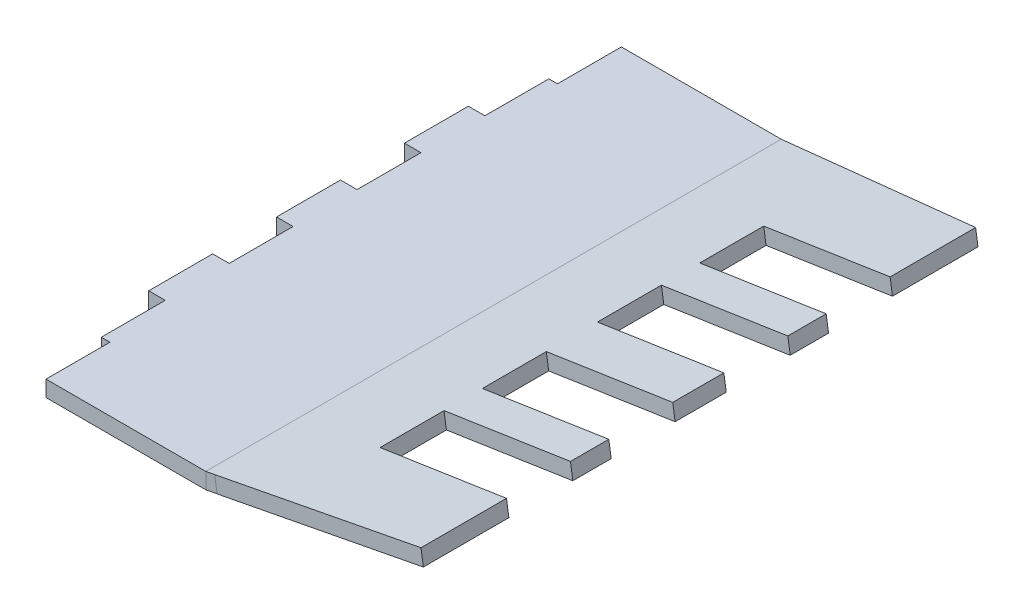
ISO-10303-21;
HEADER;
FILE_DESCRIPTION(('STEP AP214'),'2;1');
FILE_NAME('part.step','',(''),(''),'','','');
FILE_SCHEMA(('AUTOMOTIVE_DESIGN { 1 0 10303 214 1 1 1 1 }'));
ENDSEC;
DATA;
#1=APPLICATION_CONTEXT('core data for automotive mechanical design processes');
#2=APPLICATION_PROTOCOL_DEFINITION('international standard','automotive_design',2000,#1);
#3=PRODUCT_CONTEXT('',#1,'mechanical');
#4=PRODUCT('Part','Part','',(#3));
#5=PRODUCT_RELATED_PRODUCT_CATEGORY('part','',(#4));
#6=PRODUCT_DEFINITION_FORMATION('','',#4);
#7=PRODUCT_DEFINITION_CONTEXT('part definition',#1,'design');
#8=PRODUCT_DEFINITION('design','',#6,#7);
#9=PRODUCT_DEFINITION_SHAPE('','',#8);
#10=(LENGTH_UNIT() NAMED_UNIT(*) SI_UNIT(.MILLI.,.METRE.));
#11=(NAMED_UNIT(*) PLANE_ANGLE_UNIT() SI_UNIT($,.RADIAN.));
#12=(NAMED_UNIT(*) SI_UNIT($,.STERADIAN.) SOLID_ANGLE_UNIT());
#13=UNCERTAINTY_MEASURE_WITH_UNIT(LENGTH_MEASURE(1.E-05),#10,'distance_accuracy_value','');
#14=(GEOMETRIC_REPRESENTATION_CONTEXT(3) GLOBAL_UNCERTAINTY_ASSIGNED_CONTEXT((#13)) GLOBAL_UNIT_ASSIGNED_CONTEXT((#10,
#11,#12)) REPRESENTATION_CONTEXT('',''));
#15=CARTESIAN_POINT('',(0.,0.,0.));
#16=DIRECTION('',(0.,0.,1.));
#17=DIRECTION('',(1.,0.,0.));
#18=AXIS2_PLACEMENT_3D('',#15,#16,#17);
#19=CARTESIAN_POINT('',(-98.0745799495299,1598.50930668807,-114.3));
#20=DIRECTION('',(0.0506743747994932,0.,-0.998715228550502));
#21=DIRECTION('',(-0.998715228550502,0.,-0.0506743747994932));
#22=AXIS2_PLACEMENT_3D('',#19,#20,#21);
#23=PLANE('',#22);
#24=DIRECTION('',(0.987410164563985,0.150036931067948,0.0501007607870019));
#25=VECTOR('',#24,1.);
#26=CARTESIAN_POINT('',(-7.71650705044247,1002.32157201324,-109.715270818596));
#27=LINE('',#26,#25);
#28=CARTESIAN_POINT('',(-65.1690093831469,993.591666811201,-112.630385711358));
#29=VERTEX_POINT('',#28);
#30=CARTESIAN_POINT('',(-57.4738199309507,994.76095050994,-112.23993515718));
#31=VERTEX_POINT('',#30);
#32=EDGE_CURVE('E1581',#29,#31,#27,.T.);
#33=ORIENTED_EDGE('',*,*,#32,.T.);
#34=DIRECTION('',(0.150221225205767,-0.988623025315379,0.00762215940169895));
#35=VECTOR('',#34,1.);
#36=CARTESIAN_POINT('',(-148.056366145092,1590.89502381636,-116.836054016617));
#37=LINE('',#36,#35);
#38=CARTESIAN_POINT('',(-57.4521875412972,994.618585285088,-112.238837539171));
#39=VERTEX_POINT('',#38);
#40=EDGE_CURVE('E1585',#31,#39,#37,.T.);
#41=ORIENTED_EDGE('',*,*,#40,.T.);
#42=DIRECTION('',(-0.986000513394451,-0.159059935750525,-0.0500292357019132));
#43=VECTOR('',#42,1.);
#44=CARTESIAN_POINT('',(-2.33672966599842,1003.50971776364,-109.442303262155));
#45=LINE('',#44,#43);
#46=CARTESIAN_POINT('',(-65.1690093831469,993.373720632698,-112.630385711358));
#47=VERTEX_POINT('',#46);
#48=EDGE_CURVE('E1641',#39,#47,#45,.T.);
#49=ORIENTED_EDGE('',*,*,#48,.T.);
#50=DIRECTION('',(0.,1.,0.));
#51=VECTOR('',#50,1.);
#52=CARTESIAN_POINT('',(-65.1690093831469,1598.50930668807,-112.630385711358));
#53=LINE('',#52,#51);
#54=EDGE_CURVE('E1644',#47,#29,#53,.T.);
#55=ORIENTED_EDGE('',*,*,#54,.T.);
#56=EDGE_LOOP('',(#33,#41,#49,#55));
#57=FACE_BOUND('',#56,.T.);
#58=ADVANCED_FACE('F1243',(#57),#23,.T.);
#59=CARTESIAN_POINT('',(465.09542005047,1074.16532353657,-114.3));
#60=DIRECTION('',(-0.150225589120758,0.988651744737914,0.));
#61=DIRECTION('',(-0.988651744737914,-0.150225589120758,0.));
#62=AXIS2_PLACEMENT_3D('',#59,#60,#61);
#63=PLANE('',#62);
#64=DIRECTION('',(-0.987410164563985,-0.150036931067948,0.0501007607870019));
#65=VECTOR('',#64,1.);
#66=CARTESIAN_POINT('',(-148.911809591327,980.866952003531,2.5794588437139));
#67=LINE('',#66,#65);
#68=CARTESIAN_POINT('',(-57.4738199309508,994.760950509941,-2.06006484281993));
#69=VERTEX_POINT('',#68);
#70=CARTESIAN_POINT('',(-96.474612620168,988.834781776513,-0.0811816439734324));
#71=VERTEX_POINT('',#70);
#72=EDGE_CURVE('E1580',#69,#71,#67,.T.);
#73=ORIENTED_EDGE('',*,*,#72,.F.);
#74=DIRECTION('',(0.,0.,-1.));
#75=VECTOR('',#74,1.);
#76=CARTESIAN_POINT('',(-57.4738199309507,994.76095050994,-114.300000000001));
#77=LINE('',#76,#75);
#78=CARTESIAN_POINT('',(-57.4738199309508,994.76095050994,-19.05));
#79=VERTEX_POINT('',#78);
#80=EDGE_CURVE('E1662',#69,#79,#77,.T.);
#81=ORIENTED_EDGE('',*,*,#80,.T.);
#82=DIRECTION('',(-0.988651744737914,-0.150225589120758,0.));
#83=VECTOR('',#82,1.);
#84=CARTESIAN_POINT('',(465.09542005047,1074.16532353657,-19.0500000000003));
#85=LINE('',#84,#83);
#86=CARTESIAN_POINT('',(-82.5855742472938,990.945220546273,-19.05));
#87=VERTEX_POINT('',#86);
#88=EDGE_CURVE('E1657',#79,#87,#85,.T.);
#89=ORIENTED_EDGE('',*,*,#88,.T.);
#90=DIRECTION('',(0.,0.,-1.));
#91=VECTOR('',#90,1.);
#92=CARTESIAN_POINT('',(-82.5855742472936,990.945220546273,-114.300000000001));
#93=LINE('',#92,#91);
#94=CARTESIAN_POINT('',(-82.5855742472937,990.945220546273,-31.75));
#95=VERTEX_POINT('',#94);
#96=EDGE_CURVE('E1661',#87,#95,#93,.T.);
#97=ORIENTED_EDGE('',*,*,#96,.T.);
#98=DIRECTION('',(0.988651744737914,0.150225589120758,0.));
#99=VECTOR('',#98,1.);
#100=CARTESIAN_POINT('',(465.09542005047,1074.16532353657,-31.75));
#101=LINE('',#100,#99);
#102=CARTESIAN_POINT('',(-57.4738199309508,994.76095050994,-31.75));
#103=VERTEX_POINT('',#102);
#104=EDGE_CURVE('E1666',#95,#103,#101,.T.);
#105=ORIENTED_EDGE('',*,*,#104,.T.);
#106=DIRECTION('',(0.,0.,-1.));
#107=VECTOR('',#106,1.);
#108=CARTESIAN_POINT('',(-57.4738199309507,994.76095050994,-114.300000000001));
#109=LINE('',#108,#107);
#110=CARTESIAN_POINT('',(-57.4738199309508,994.76095050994,-39.37));
#111=VERTEX_POINT('',#110);
#112=EDGE_CURVE('E1670',#103,#111,#109,.T.);
#113=ORIENTED_EDGE('',*,*,#112,.T.);
#114=DIRECTION('',(-0.988651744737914,-0.150225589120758,0.));
#115=VECTOR('',#114,1.);
#116=CARTESIAN_POINT('',(465.09542005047,1074.16532353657,-39.37));
#117=LINE('',#116,#115);
#118=CARTESIAN_POINT('',(-82.5855742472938,990.945220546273,-39.37));
#119=VERTEX_POINT('',#118);
#120=EDGE_CURVE('E1674',#111,#119,#117,.T.);
#121=ORIENTED_EDGE('',*,*,#120,.T.);
#122=DIRECTION('',(0.,0.,-1.));
#123=VECTOR('',#122,1.);
#124=CARTESIAN_POINT('',(-82.5855742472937,990.945220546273,-114.3));
#125=LINE('',#124,#123);
#126=CARTESIAN_POINT('',(-82.5855742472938,990.945220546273,-52.07));
#127=VERTEX_POINT('',#126);
#128=EDGE_CURVE('E1678',#119,#127,#125,.T.);
#129=ORIENTED_EDGE('',*,*,#128,.T.);
#130=DIRECTION('',(-0.988651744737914,-0.150225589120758,0.));
#131=VECTOR('',#130,1.);
#132=CARTESIAN_POINT('',(465.09542005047,1074.16532353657,-52.0700000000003));
#133=LINE('',#132,#131);
#134=CARTESIAN_POINT('',(-57.4738199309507,994.76095050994,-52.07));
#135=VERTEX_POINT('',#134);
#136=EDGE_CURVE('E1683',#135,#127,#133,.T.);
#137=ORIENTED_EDGE('',*,*,#136,.F.);
#138=DIRECTION('',(0.,0.,-1.));
#139=VECTOR('',#138,1.);
#140=CARTESIAN_POINT('',(-57.4738199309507,994.76095050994,-114.300000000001));
#141=LINE('',#140,#139);
#142=CARTESIAN_POINT('',(-57.4738199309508,994.76095050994,-62.23));
#143=VERTEX_POINT('',#142);
#144=EDGE_CURVE('E1682',#135,#143,#141,.T.);
#145=ORIENTED_EDGE('',*,*,#144,.T.);
#146=DIRECTION('',(-0.988651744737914,-0.150225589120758,0.));
#147=VECTOR('',#146,1.);
#148=CARTESIAN_POINT('',(465.09542005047,1074.16532353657,-62.23));
#149=LINE('',#148,#147);
#150=CARTESIAN_POINT('',(-82.5855742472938,990.945220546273,-62.23));
#151=VERTEX_POINT('',#150);
#152=EDGE_CURVE('E1692',#143,#151,#149,.T.);
#153=ORIENTED_EDGE('',*,*,#152,.T.);
#154=DIRECTION('',(0.,0.,1.));
#155=VECTOR('',#154,1.);
#156=CARTESIAN_POINT('',(-82.5855742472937,990.945220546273,-114.3));
#157=LINE('',#156,#155);
#158=CARTESIAN_POINT('',(-82.5855742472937,990.945220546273,-74.93));
#159=VERTEX_POINT('',#158);
#160=EDGE_CURVE('E1697',#159,#151,#157,.T.);
#161=ORIENTED_EDGE('',*,*,#160,.F.);
#162=DIRECTION('',(-0.988651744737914,-0.150225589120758,0.));
#163=VECTOR('',#162,1.);
#164=CARTESIAN_POINT('',(465.09542005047,1074.16532353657,-74.93));
#165=LINE('',#164,#163);
#166=CARTESIAN_POINT('',(-57.4738199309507,994.76095050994,-74.93));
#167=VERTEX_POINT('',#166);
#168=EDGE_CURVE('E1703',#167,#159,#165,.T.);
#169=ORIENTED_EDGE('',*,*,#168,.F.);
#170=DIRECTION('',(0.,0.,-1.));
#171=VECTOR('',#170,1.);
#172=CARTESIAN_POINT('',(-57.4738199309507,994.76095050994,-114.300000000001));
#173=LINE('',#172,#171);
#174=CARTESIAN_POINT('',(-57.4738199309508,994.76095050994,-82.55));
#175=VERTEX_POINT('',#174);
#176=EDGE_CURVE('E1696',#167,#175,#173,.T.);
#177=ORIENTED_EDGE('',*,*,#176,.T.);
#178=DIRECTION('',(0.988651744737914,0.150225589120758,0.));
#179=VECTOR('',#178,1.);
#180=CARTESIAN_POINT('',(465.09542005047,1074.16532353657,-82.55));
#181=LINE('',#180,#179);
#182=CARTESIAN_POINT('',(-82.5855742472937,990.945220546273,-82.55));
#183=VERTEX_POINT('',#182);
#184=EDGE_CURVE('E1711',#183,#175,#181,.T.);
#185=ORIENTED_EDGE('',*,*,#184,.F.);
#186=DIRECTION('',(0.,0.,1.));
#187=VECTOR('',#186,1.);
#188=CARTESIAN_POINT('',(-82.5855742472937,990.945220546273,-114.299999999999));
#189=LINE('',#188,#187);
#190=CARTESIAN_POINT('',(-82.5855742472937,990.945220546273,-95.25));
#191=VERTEX_POINT('',#190);
#192=EDGE_CURVE('E1717',#191,#183,#189,.T.);
#193=ORIENTED_EDGE('',*,*,#192,.F.);
#194=DIRECTION('',(-0.988651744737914,-0.150225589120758,0.));
#195=VECTOR('',#194,1.);
#196=CARTESIAN_POINT('',(465.09542005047,1074.16532353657,-95.25));
#197=LINE('',#196,#195);
#198=CARTESIAN_POINT('',(-57.4738199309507,994.76095050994,-95.25));
#199=VERTEX_POINT('',#198);
#200=EDGE_CURVE('E1722',#199,#191,#197,.T.);
#201=ORIENTED_EDGE('',*,*,#200,.F.);
#202=DIRECTION('',(0.,0.,-1.));
#203=VECTOR('',#202,1.);
#204=CARTESIAN_POINT('',(-57.4738199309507,994.76095050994,-114.300000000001));
#205=LINE('',#204,#203);
#206=EDGE_CURVE('E1592',#199,#31,#205,.T.);
#207=ORIENTED_EDGE('',*,*,#206,.T.);
#208=ORIENTED_EDGE('',*,*,#32,.F.);
#209=DIRECTION('',(-0.987416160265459,-0.150037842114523,-0.0499797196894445));
#210=VECTOR('',#209,1.);
#211=CARTESIAN_POINT('',(463.688437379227,1073.95153258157,-85.8613819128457));
#212=LINE('',#211,#210);
#213=CARTESIAN_POINT('',(-96.4746126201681,988.834781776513,-114.214971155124));
#214=VERTEX_POINT('',#213);
#215=EDGE_CURVE('E1587',#29,#214,#212,.T.);
#216=ORIENTED_EDGE('',*,*,#215,.T.);
#217=CARTESIAN_POINT('',(-98.1544710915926,988.579527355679,-114.3));
#218=VERTEX_POINT('',#217);
#219=EDGE_CURVE('E1591',#214,#218,#212,.T.);
#220=ORIENTED_EDGE('',*,*,#219,.T.);
#221=DIRECTION('',(0.,0.,1.));
#222=VECTOR('',#221,1.);
#223=CARTESIAN_POINT('',(-98.1544710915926,988.579527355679,-114.3));
#224=LINE('',#223,#222);
#225=CARTESIAN_POINT('',(-98.1544710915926,988.579527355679,0.));
#226=VERTEX_POINT('',#225);
#227=EDGE_CURVE('E1574',#218,#226,#224,.T.);
#228=ORIENTED_EDGE('',*,*,#227,.T.);
#229=DIRECTION('',(-0.988651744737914,-0.150225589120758,0.));
#230=VECTOR('',#229,1.);
#231=CARTESIAN_POINT('',(465.09542005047,1074.16532353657,0.));
#232=LINE('',#231,#230);
#233=CARTESIAN_POINT('',(-98.0745799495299,988.591666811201,0.));
#234=VERTEX_POINT('',#233);
#235=EDGE_CURVE('E1547',#234,#226,#232,.T.);
#236=ORIENTED_EDGE('',*,*,#235,.F.);
#237=DIRECTION('',(0.987410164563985,0.150036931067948,-0.0501007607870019));
#238=VECTOR('',#237,1.);
#239=CARTESIAN_POINT('',(-7.71650705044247,1002.32157201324,-4.58472918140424));
#240=LINE('',#239,#238);
#241=EDGE_CURVE('E1569',#234,#71,#240,.T.);
#242=ORIENTED_EDGE('',*,*,#241,.T.);
#243=EDGE_LOOP('',(#73,#81,#89,#97,#105,#113,#121,#129,#137,#145,#153,#161,#169,#177,#185,#193,
#201,#207,#208,#216,#220,#228,#236,#242));
#244=FACE_BOUND('',#243,.T.);
#245=ADVANCED_FACE('F1245',(#244),#63,.T.);
#246=CARTESIAN_POINT('',(-123.475772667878,851.484732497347,-116.585834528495));
#247=DIRECTION('',(-0.0494635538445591,-0.00751598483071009,0.998747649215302));
#248=DIRECTION('',(0.998775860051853,0.,0.0494649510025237));
#249=AXIS2_PLACEMENT_3D('',#246,#247,#248);
#250=PLANE('',#249);
#251=DIRECTION('',(-0.150225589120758,0.988651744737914,0.));
#252=VECTOR('',#251,1.);
#253=CARTESIAN_POINT('',(-37.6838368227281,864.520813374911,-112.238837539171));
#254=LINE('',#253,#252);
#255=CARTESIAN_POINT('',(-57.0035747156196,991.666213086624,-112.238837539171));
#256=VERTEX_POINT('',#255);
#257=EDGE_CURVE('E1649',#256,#39,#254,.T.);
#258=ORIENTED_EDGE('',*,*,#257,.F.);
#259=DIRECTION('',(-0.987413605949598,-0.150037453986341,-0.0500313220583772));
#260=VECTOR('',#259,1.);
#261=CARTESIAN_POINT('',(-142.79551056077,978.63013220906,-116.585834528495));
#262=LINE('',#261,#260);
#263=CARTESIAN_POINT('',(-96.0043674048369,985.740044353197,-114.214971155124));
#264=VERTEX_POINT('',#263);
#265=EDGE_CURVE('E1887',#256,#264,#262,.T.);
#266=ORIENTED_EDGE('',*,*,#265,.T.);
#267=DIRECTION('',(-0.150225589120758,0.988651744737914,0.));
#268=VECTOR('',#267,1.);
#269=CARTESIAN_POINT('',(-76.6846295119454,858.594644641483,-114.214971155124));
#270=LINE('',#269,#268);
#271=EDGE_CURVE('E1573',#264,#214,#270,.T.);
#272=ORIENTED_EDGE('',*,*,#271,.T.);
#273=DIRECTION('',(-0.988412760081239,-0.143308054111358,-0.0500301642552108));
#274=VECTOR('',#273,1.);
#275=CARTESIAN_POINT('',(-53.7250800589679,995.032953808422,-112.05113209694));
#276=LINE('',#275,#274);
#277=EDGE_CURVE('E1579',#47,#214,#276,.T.);
#278=ORIENTED_EDGE('',*,*,#277,.F.);
#279=ORIENTED_EDGE('',*,*,#48,.F.);
#280=EDGE_LOOP('',(#258,#266,#272,#278,#279));
#281=FACE_BOUND('',#280,.T.);
#282=ADVANCED_FACE('F2101',(#281),#250,.F.);
#283=CARTESIAN_POINT('',(-129.121826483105,850.626814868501,2.5794588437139));
#284=DIRECTION('',(-0.0495322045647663,-0.00752641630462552,-0.998744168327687));
#285=DIRECTION('',(-0.998772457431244,0.,0.0495336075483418));
#286=AXIS2_PLACEMENT_3D('',#283,#284,#285);
#287=PLANE('',#286);
#288=DIRECTION('',(-0.150225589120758,0.988651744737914,0.));
#289=VECTOR('',#288,1.);
#290=CARTESIAN_POINT('',(-76.6846295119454,858.594644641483,-0.0811816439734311));
#291=LINE('',#290,#289);
#292=CARTESIAN_POINT('',(-96.0043674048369,985.740044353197,-0.0811816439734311));
#293=VERTEX_POINT('',#292);
#294=EDGE_CURVE('E1614',#293,#71,#291,.T.);
#295=ORIENTED_EDGE('',*,*,#294,.F.);
#296=DIRECTION('',(0.987410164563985,0.150036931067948,-0.0501007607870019));
#297=VECTOR('',#296,1.);
#298=CARTESIAN_POINT('',(-148.441564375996,977.772214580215,2.5794588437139));
#299=LINE('',#298,#297);
#300=CARTESIAN_POINT('',(-57.0035747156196,991.666213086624,-2.06006484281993));
#301=VERTEX_POINT('',#300);
#302=EDGE_CURVE('E1876',#293,#301,#299,.T.);
#303=ORIENTED_EDGE('',*,*,#302,.T.);
#304=DIRECTION('',(0.150225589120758,-0.988651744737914,0.));
#305=VECTOR('',#304,1.);
#306=CARTESIAN_POINT('',(-37.6838368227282,864.520813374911,-2.06006484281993));
#307=LINE('',#306,#305);
#308=EDGE_CURVE('E1769',#69,#301,#307,.T.);
#309=ORIENTED_EDGE('',*,*,#308,.F.);
#310=ORIENTED_EDGE('',*,*,#72,.T.);
#311=EDGE_LOOP('',(#295,#303,#309,#310));
#312=FACE_BOUND('',#311,.T.);
#313=ADVANCED_FACE('F2108',(#312),#287,.F.);
#314=CARTESIAN_POINT('',(-98.0745799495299,1598.50930668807,0.));
#315=DIRECTION('',(-0.0506743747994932,0.,-0.998715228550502));
#316=DIRECTION('',(-0.998715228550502,0.,0.0506743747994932));
#317=AXIS2_PLACEMENT_3D('',#314,#315,#316);
#318=PLANE('',#317);
#319=DIRECTION('',(0.,-1.,0.));
#320=VECTOR('',#319,1.);
#321=CARTESIAN_POINT('',(-98.0745799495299,1598.50930668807,0.));
#322=LINE('',#321,#320);
#323=CARTESIAN_POINT('',(-98.07457994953,985.425475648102,0.));
#324=VERTEX_POINT('',#323);
#325=EDGE_CURVE('E1575',#234,#324,#322,.T.);
#326=ORIENTED_EDGE('',*,*,#325,.T.);
#327=DIRECTION('',(0.987410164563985,0.150036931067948,-0.0501007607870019));
#328=VECTOR('',#327,1.);
#329=CARTESIAN_POINT('',(-7.24744219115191,999.226655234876,-4.60852932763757));
#330=LINE('',#329,#328);
#331=CARTESIAN_POINT('',(-96.0043674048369,985.740044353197,-0.105041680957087));
#332=VERTEX_POINT('',#331);
#333=EDGE_CURVE('E1872',#324,#332,#330,.T.);
#334=ORIENTED_EDGE('',*,*,#333,.T.);
#335=DIRECTION('',(0.150221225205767,-0.988623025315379,-0.00762215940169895));
#336=VECTOR('',#335,1.);
#337=CARTESIAN_POINT('',(-187.054892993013,1584.95394332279,4.51482224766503));
#338=LINE('',#337,#336);
#339=EDGE_CURVE('E1645',#71,#332,#338,.T.);
#340=ORIENTED_EDGE('',*,*,#339,.F.);
#341=ORIENTED_EDGE('',*,*,#241,.F.);
#342=EDGE_LOOP('',(#326,#334,#340,#341));
#343=FACE_BOUND('',#342,.T.);
#344=ADVANCED_FACE('F2105',(#343),#318,.F.);
#345=CARTESIAN_POINT('',(-65.1690093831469,1074.16532353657,-112.630385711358));
#346=DIRECTION('',(0.0505519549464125,0.,-0.998721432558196));
#347=DIRECTION('',(-0.998721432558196,0.,-0.0505519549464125));
#348=AXIS2_PLACEMENT_3D('',#345,#346,#347);
#349=PLANE('',#348);
#350=ORIENTED_EDGE('',*,*,#54,.F.);
#351=ORIENTED_EDGE('',*,*,#277,.T.);
#352=ORIENTED_EDGE('',*,*,#215,.F.);
#353=EDGE_LOOP('',(#350,#351,#352));
#354=FACE_BOUND('',#353,.T.);
#355=ADVANCED_FACE('F2107',(#354),#349,.T.);
#356=DIRECTION('',(0.987416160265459,0.150037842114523,0.0499797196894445));
#357=VECTOR('',#356,1.);
#358=CARTESIAN_POINT('',(-52.7629685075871,992.310573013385,-112.002433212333));
#359=LINE('',#358,#357);
#360=CARTESIAN_POINT('',(-98.1544710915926,985.41333619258,-114.3));
#361=VERTEX_POINT('',#360);
#362=CARTESIAN_POINT('',(-96.0043674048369,985.740044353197,-114.191168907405));
#363=VERTEX_POINT('',#362);
#364=EDGE_CURVE('E1884',#361,#363,#359,.T.);
#365=ORIENTED_EDGE('',*,*,#364,.F.);
#366=DIRECTION('',(0.,-1.,0.));
#367=VECTOR('',#366,1.);
#368=CARTESIAN_POINT('',(-98.1544710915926,1074.16532353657,-114.3));
#369=LINE('',#368,#367);
#370=EDGE_CURVE('E1558',#218,#361,#369,.T.);
#371=ORIENTED_EDGE('',*,*,#370,.F.);
#372=ORIENTED_EDGE('',*,*,#219,.F.);
#373=DIRECTION('',(0.15022124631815,-0.988623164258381,0.00760369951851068));
#374=VECTOR('',#373,1.);
#375=CARTESIAN_POINT('',(-108.438973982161,1067.57360919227,-114.82056730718));
#376=LINE('',#375,#374);
#377=EDGE_CURVE('E1623',#214,#363,#376,.T.);
#378=ORIENTED_EDGE('',*,*,#377,.T.);
#379=EDGE_LOOP('',(#365,#371,#372,#378));
#380=FACE_BOUND('',#379,.T.);
#381=ADVANCED_FACE('F1986',(#380),#349,.T.);
#382=CARTESIAN_POINT('',(-134.90457994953,988.579527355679,-114.3));
#383=DIRECTION('',(-1.,0.,0.));
#384=DIRECTION('',(0.,0.,1.));
#385=AXIS2_PLACEMENT_3D('',#382,#383,#384);
#386=PLANE('',#385);
#387=DIRECTION('',(0.,0.,-1.));
#388=VECTOR('',#387,1.);
#389=CARTESIAN_POINT('',(-134.90457994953,985.404527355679,0.));
#390=LINE('',#389,#388);
#391=CARTESIAN_POINT('',(-134.90457994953,985.404527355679,-25.4));
#392=VERTEX_POINT('',#391);
#393=CARTESIAN_POINT('',(-134.90457994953,985.404527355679,-38.1));
#394=VERTEX_POINT('',#393);
#395=EDGE_CURVE('E1824',#392,#394,#390,.T.);
#396=ORIENTED_EDGE('',*,*,#395,.F.);
#397=DIRECTION('',(0.,1.,0.));
#398=VECTOR('',#397,1.);
#399=CARTESIAN_POINT('',(-134.90457994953,983.579527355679,-25.4));
#400=LINE('',#399,#398);
#401=CARTESIAN_POINT('',(-134.90457994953,988.579527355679,-25.4));
#402=VERTEX_POINT('',#401);
#403=EDGE_CURVE('E1620',#392,#402,#400,.T.);
#404=ORIENTED_EDGE('',*,*,#403,.T.);
#405=DIRECTION('',(0.,0.,1.));
#406=VECTOR('',#405,1.);
#407=CARTESIAN_POINT('',(-134.90457994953,988.579527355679,-114.3));
#408=LINE('',#407,#406);
#409=CARTESIAN_POINT('',(-134.90457994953,988.579527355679,-38.1));
#410=VERTEX_POINT('',#409);
#411=EDGE_CURVE('E1561',#410,#402,#408,.T.);
#412=ORIENTED_EDGE('',*,*,#411,.F.);
#413=DIRECTION('',(0.,1.,0.));
#414=VECTOR('',#413,1.);
#415=CARTESIAN_POINT('',(-134.90457994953,983.579527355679,-38.1));
#416=LINE('',#415,#414);
#417=EDGE_CURVE('E1630',#394,#410,#416,.T.);
#418=ORIENTED_EDGE('',*,*,#417,.F.);
#419=EDGE_LOOP('',(#396,#404,#412,#418));
#420=FACE_BOUND('',#419,.T.);
#421=ADVANCED_FACE('F2030',(#420),#386,.T.);
#422=CARTESIAN_POINT('',(-134.90457994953,985.404527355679,-50.8));
#423=VERTEX_POINT('',#422);
#424=CARTESIAN_POINT('',(-134.90457994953,985.404527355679,-63.5));
#425=VERTEX_POINT('',#424);
#426=EDGE_CURVE('E1823',#423,#425,#390,.T.);
#427=ORIENTED_EDGE('',*,*,#426,.F.);
#428=DIRECTION('',(0.,1.,0.));
#429=VECTOR('',#428,1.);
#430=CARTESIAN_POINT('',(-134.90457994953,983.579527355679,-50.8));
#431=LINE('',#430,#429);
#432=CARTESIAN_POINT('',(-134.90457994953,988.579527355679,-50.8));
#433=VERTEX_POINT('',#432);
#434=EDGE_CURVE('E1608',#423,#433,#431,.T.);
#435=ORIENTED_EDGE('',*,*,#434,.T.);
#436=CARTESIAN_POINT('',(-134.90457994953,988.579527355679,-63.5));
#437=VERTEX_POINT('',#436);
#438=EDGE_CURVE('E1962',#437,#433,#408,.T.);
#439=ORIENTED_EDGE('',*,*,#438,.F.);
#440=DIRECTION('',(0.,1.,0.));
#441=VECTOR('',#440,1.);
#442=CARTESIAN_POINT('',(-134.90457994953,983.579527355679,-63.5));
#443=LINE('',#442,#441);
#444=EDGE_CURVE('E1556',#425,#437,#443,.T.);
#445=ORIENTED_EDGE('',*,*,#444,.F.);
#446=EDGE_LOOP('',(#427,#435,#439,#445));
#447=FACE_BOUND('',#446,.T.);
#448=ADVANCED_FACE('F2045',(#447),#386,.T.);
#449=CARTESIAN_POINT('',(-134.90457994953,985.404527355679,-76.2));
#450=VERTEX_POINT('',#449);
#451=CARTESIAN_POINT('',(-134.90457994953,985.404527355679,-88.9));
#452=VERTEX_POINT('',#451);
#453=EDGE_CURVE('E1808',#450,#452,#390,.T.);
#454=ORIENTED_EDGE('',*,*,#453,.F.);
#455=DIRECTION('',(0.,1.,0.));
#456=VECTOR('',#455,1.);
#457=CARTESIAN_POINT('',(-134.90457994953,983.579527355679,-76.2));
#458=LINE('',#457,#456);
#459=CARTESIAN_POINT('',(-134.90457994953,988.579527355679,-76.2));
#460=VERTEX_POINT('',#459);
#461=EDGE_CURVE('E1604',#450,#460,#458,.T.);
#462=ORIENTED_EDGE('',*,*,#461,.T.);
#463=CARTESIAN_POINT('',(-134.90457994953,988.579527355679,-88.9));
#464=VERTEX_POINT('',#463);
#465=EDGE_CURVE('E1607',#464,#460,#408,.T.);
#466=ORIENTED_EDGE('',*,*,#465,.F.);
#467=DIRECTION('',(0.,1.,0.));
#468=VECTOR('',#467,1.);
#469=CARTESIAN_POINT('',(-134.90457994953,983.579527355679,-88.9));
#470=LINE('',#469,#468);
#471=EDGE_CURVE('E1611',#452,#464,#470,.T.);
#472=ORIENTED_EDGE('',*,*,#471,.F.);
#473=EDGE_LOOP('',(#454,#462,#466,#472));
#474=FACE_BOUND('',#473,.T.);
#475=ADVANCED_FACE('F2068',(#474),#386,.T.);
#476=CARTESIAN_POINT('',(-98.1544710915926,988.579527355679,-114.3));
#477=DIRECTION('',(0.,1.,0.));
#478=DIRECTION('',(0.,0.,1.));
#479=AXIS2_PLACEMENT_3D('',#476,#477,#478);
#480=PLANE('',#479);
#481=DIRECTION('',(-1.,0.,0.));
#482=VECTOR('',#481,1.);
#483=CARTESIAN_POINT('',(-131.61913049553,988.579527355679,-12.7000000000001));
#484=LINE('',#483,#482);
#485=CARTESIAN_POINT('',(-129.90457994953,988.579527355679,-12.7000000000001));
#486=VERTEX_POINT('',#485);
#487=CARTESIAN_POINT('',(-131.61913049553,988.579527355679,-12.7000000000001));
#488=VERTEX_POINT('',#487);
#489=EDGE_CURVE('E1533',#486,#488,#484,.T.);
#490=ORIENTED_EDGE('',*,*,#489,.F.);
#491=DIRECTION('',(0.,0.,-1.));
#492=VECTOR('',#491,1.);
#493=CARTESIAN_POINT('',(-129.90457994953,988.579527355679,0.));
#494=LINE('',#493,#492);
#495=CARTESIAN_POINT('',(-129.90457994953,988.579527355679,0.));
#496=VERTEX_POINT('',#495);
#497=EDGE_CURVE('E1526',#496,#486,#494,.T.);
#498=ORIENTED_EDGE('',*,*,#497,.F.);
#499=DIRECTION('',(-1.,0.,0.));
#500=VECTOR('',#499,1.);
#501=CARTESIAN_POINT('',(-98.1544710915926,988.579527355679,0.));
#502=LINE('',#501,#500);
#503=EDGE_CURVE('E1539',#226,#496,#502,.T.);
#504=ORIENTED_EDGE('',*,*,#503,.F.);
#505=ORIENTED_EDGE('',*,*,#227,.F.);
#506=DIRECTION('',(-1.,0.,0.));
#507=VECTOR('',#506,1.);
#508=CARTESIAN_POINT('',(-98.1544710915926,988.579527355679,-114.3));
#509=LINE('',#508,#507);
#510=CARTESIAN_POINT('',(-129.90457994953,988.579527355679,-114.3));
#511=VERTEX_POINT('',#510);
#512=EDGE_CURVE('E1564',#218,#511,#509,.T.);
#513=ORIENTED_EDGE('',*,*,#512,.T.);
#514=DIRECTION('',(0.,0.,-1.));
#515=VECTOR('',#514,1.);
#516=CARTESIAN_POINT('',(-129.90457994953,988.579527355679,-114.3));
#517=LINE('',#516,#515);
#518=CARTESIAN_POINT('',(-129.90457994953,988.579527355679,-101.6));
#519=VERTEX_POINT('',#518);
#520=EDGE_CURVE('E2001',#519,#511,#517,.T.);
#521=ORIENTED_EDGE('',*,*,#520,.F.);
#522=DIRECTION('',(1.,0.,0.));
#523=VECTOR('',#522,1.);
#524=CARTESIAN_POINT('',(-131.61913049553,988.579527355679,-101.6));
#525=LINE('',#524,#523);
#526=CARTESIAN_POINT('',(-131.61913049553,988.579527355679,-101.6));
#527=VERTEX_POINT('',#526);
#528=EDGE_CURVE('E1542',#527,#519,#525,.T.);
#529=ORIENTED_EDGE('',*,*,#528,.F.);
#530=DIRECTION('',(0.,0.,-1.));
#531=VECTOR('',#530,1.);
#532=CARTESIAN_POINT('',(-131.61913049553,988.579527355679,-114.3));
#533=LINE('',#532,#531);
#534=CARTESIAN_POINT('',(-131.61913049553,988.579527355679,-88.9));
#535=VERTEX_POINT('',#534);
#536=EDGE_CURVE('E1619',#535,#527,#533,.T.);
#537=ORIENTED_EDGE('',*,*,#536,.F.);
#538=DIRECTION('',(1.,0.,0.));
#539=VECTOR('',#538,1.);
#540=CARTESIAN_POINT('',(-98.1544710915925,988.579527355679,-88.9000000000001));
#541=LINE('',#540,#539);
#542=EDGE_CURVE('E1615',#464,#535,#541,.T.);
#543=ORIENTED_EDGE('',*,*,#542,.F.);
#544=ORIENTED_EDGE('',*,*,#465,.T.);
#545=DIRECTION('',(1.,0.,0.));
#546=VECTOR('',#545,1.);
#547=CARTESIAN_POINT('',(-98.1544710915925,988.579527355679,-76.2000000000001));
#548=LINE('',#547,#546);
#549=CARTESIAN_POINT('',(-131.61913049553,988.579527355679,-76.2));
#550=VERTEX_POINT('',#549);
#551=EDGE_CURVE('E1966',#460,#550,#548,.T.);
#552=ORIENTED_EDGE('',*,*,#551,.T.);
#553=DIRECTION('',(0.,0.,-1.));
#554=VECTOR('',#553,1.);
#555=CARTESIAN_POINT('',(-131.61913049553,988.579527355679,-114.3));
#556=LINE('',#555,#554);
#557=CARTESIAN_POINT('',(-131.61913049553,988.579527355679,-63.5));
#558=VERTEX_POINT('',#557);
#559=EDGE_CURVE('E1600',#558,#550,#556,.T.);
#560=ORIENTED_EDGE('',*,*,#559,.F.);
#561=DIRECTION('',(1.,0.,0.));
#562=VECTOR('',#561,1.);
#563=CARTESIAN_POINT('',(-98.1544710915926,988.579527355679,-63.5));
#564=LINE('',#563,#562);
#565=EDGE_CURVE('E1550',#437,#558,#564,.T.);
#566=ORIENTED_EDGE('',*,*,#565,.F.);
#567=ORIENTED_EDGE('',*,*,#438,.T.);
#568=DIRECTION('',(1.,0.,0.));
#569=VECTOR('',#568,1.);
#570=CARTESIAN_POINT('',(-98.1544710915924,988.579527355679,-50.8000000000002));
#571=LINE('',#570,#569);
#572=CARTESIAN_POINT('',(-131.619130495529,988.579527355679,-50.8));
#573=VERTEX_POINT('',#572);
#574=EDGE_CURVE('E1958',#433,#573,#571,.T.);
#575=ORIENTED_EDGE('',*,*,#574,.T.);
#576=DIRECTION('',(0.,0.,-1.));
#577=VECTOR('',#576,1.);
#578=CARTESIAN_POINT('',(-131.619130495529,988.579527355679,-114.3));
#579=LINE('',#578,#577);
#580=CARTESIAN_POINT('',(-131.619130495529,988.579527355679,-38.1));
#581=VERTEX_POINT('',#580);
#582=EDGE_CURVE('E1638',#581,#573,#579,.T.);
#583=ORIENTED_EDGE('',*,*,#582,.F.);
#584=DIRECTION('',(1.,0.,0.));
#585=VECTOR('',#584,1.);
#586=CARTESIAN_POINT('',(-98.154471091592,988.579527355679,-38.1000000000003));
#587=LINE('',#586,#585);
#588=EDGE_CURVE('E1599',#410,#581,#587,.T.);
#589=ORIENTED_EDGE('',*,*,#588,.F.);
#590=ORIENTED_EDGE('',*,*,#411,.T.);
#591=DIRECTION('',(1.,0.,0.));
#592=VECTOR('',#591,1.);
#593=CARTESIAN_POINT('',(-98.1544710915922,988.579527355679,-25.4000000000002));
#594=LINE('',#593,#592);
#595=CARTESIAN_POINT('',(-131.619130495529,988.579527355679,-25.4));
#596=VERTEX_POINT('',#595);
#597=EDGE_CURVE('E1568',#402,#596,#594,.T.);
#598=ORIENTED_EDGE('',*,*,#597,.T.);
#599=DIRECTION('',(0.,0.,-1.));
#600=VECTOR('',#599,1.);
#601=CARTESIAN_POINT('',(-131.619130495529,988.579527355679,-114.3));
#602=LINE('',#601,#600);
#603=EDGE_CURVE('E1628',#488,#596,#602,.T.);
#604=ORIENTED_EDGE('',*,*,#603,.F.);
#605=EDGE_LOOP('',(#490,#498,#504,#505,#513,#521,#529,#537,#543,#544,#552,#560,#566,#567,#575,
#583,#589,#590,#598,#604));
#606=FACE_BOUND('',#605,.T.);
#607=ADVANCED_FACE('F1537',(#606),#480,.T.);
#608=CARTESIAN_POINT('',(0.,0.,-114.3));
#609=DIRECTION('',(0.,0.,1.));
#610=DIRECTION('',(1.,0.,0.));
#611=AXIS2_PLACEMENT_3D('',#608,#609,#610);
#612=PLANE('',#611);
#613=DIRECTION('',(-1.,0.,0.));
#614=VECTOR('',#613,1.);
#615=CARTESIAN_POINT('',(0.,985.404527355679,-114.3));
#616=LINE('',#615,#614);
#617=CARTESIAN_POINT('',(-98.2124430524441,985.404527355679,-114.3));
#618=VERTEX_POINT('',#617);
#619=CARTESIAN_POINT('',(-129.90457994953,985.404527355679,-114.3));
#620=VERTEX_POINT('',#619);
#621=EDGE_CURVE('E1900',#618,#620,#616,.T.);
#622=ORIENTED_EDGE('',*,*,#621,.T.);
#623=DIRECTION('',(0.,1.,0.));
#624=VECTOR('',#623,1.);
#625=CARTESIAN_POINT('',(-129.90457994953,978.579527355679,-114.3));
#626=LINE('',#625,#624);
#627=EDGE_CURVE('E1992',#620,#511,#626,.T.);
#628=ORIENTED_EDGE('',*,*,#627,.T.);
#629=ORIENTED_EDGE('',*,*,#512,.F.);
#630=ORIENTED_EDGE('',*,*,#370,.T.);
#631=DIRECTION('',(-0.988651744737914,-0.150225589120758,0.));
#632=VECTOR('',#631,1.);
#633=CARTESIAN_POINT('',(-148.56949131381,977.752776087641,-114.3));
#634=LINE('',#633,#632);
#635=EDGE_CURVE('E1891',#361,#618,#634,.T.);
#636=ORIENTED_EDGE('',*,*,#635,.T.);
#637=EDGE_LOOP('',(#622,#628,#629,#630,#636));
#638=FACE_BOUND('',#637,.T.);
#639=ADVANCED_FACE('F1991',(#638),#612,.F.);
#640=CARTESIAN_POINT('',(0.,0.,0.));
#641=DIRECTION('',(0.,0.,1.));
#642=DIRECTION('',(1.,0.,0.));
#643=AXIS2_PLACEMENT_3D('',#640,#641,#642);
#644=PLANE('',#643);
#645=DIRECTION('',(0.,1.,0.));
#646=VECTOR('',#645,1.);
#647=CARTESIAN_POINT('',(-129.90457994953,978.579527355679,0.));
#648=LINE('',#647,#646);
#649=CARTESIAN_POINT('',(-129.90457994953,985.404527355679,0.));
#650=VERTEX_POINT('',#649);
#651=EDGE_CURVE('E1523',#650,#496,#648,.T.);
#652=ORIENTED_EDGE('',*,*,#651,.F.);
#653=DIRECTION('',(1.,0.,0.));
#654=VECTOR('',#653,1.);
#655=CARTESIAN_POINT('',(-131.61913049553,985.404527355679,0.));
#656=LINE('',#655,#654);
#657=CARTESIAN_POINT('',(-98.2124430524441,985.404527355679,0.));
#658=VERTEX_POINT('',#657);
#659=EDGE_CURVE('E1796',#650,#658,#656,.T.);
#660=ORIENTED_EDGE('',*,*,#659,.T.);
#661=DIRECTION('',(0.988651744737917,0.15022558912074,0.));
#662=VECTOR('',#661,1.);
#663=CARTESIAN_POINT('',(-98.2124430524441,985.404527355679,0.));
#664=LINE('',#663,#662);
#665=EDGE_CURVE('E1802',#658,#324,#664,.T.);
#666=ORIENTED_EDGE('',*,*,#665,.T.);
#667=ORIENTED_EDGE('',*,*,#325,.F.);
#668=ORIENTED_EDGE('',*,*,#235,.T.);
#669=ORIENTED_EDGE('',*,*,#503,.T.);
#670=EDGE_LOOP('',(#652,#660,#666,#667,#668,#669));
#671=FACE_BOUND('',#670,.T.);
#672=ADVANCED_FACE('F1544',(#671),#644,.T.);
#673=CARTESIAN_POINT('',(0.,983.579527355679,-63.5));
#674=DIRECTION('',(0.,0.,1.));
#675=DIRECTION('',(1.,0.,0.));
#676=AXIS2_PLACEMENT_3D('',#673,#674,#675);
#677=PLANE('',#676);
#678=DIRECTION('',(0.,1.,0.));
#679=VECTOR('',#678,1.);
#680=CARTESIAN_POINT('',(-131.61913049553,983.579527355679,-63.5));
#681=LINE('',#680,#679);
#682=CARTESIAN_POINT('',(-131.61913049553,985.404527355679,-63.5));
#683=VERTEX_POINT('',#682);
#684=EDGE_CURVE('E1596',#683,#558,#681,.T.);
#685=ORIENTED_EDGE('',*,*,#684,.F.);
#686=DIRECTION('',(-1.,0.,0.));
#687=VECTOR('',#686,1.);
#688=CARTESIAN_POINT('',(0.,985.404527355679,-63.5));
#689=LINE('',#688,#687);
#690=EDGE_CURVE('E1586',#683,#425,#689,.T.);
#691=ORIENTED_EDGE('',*,*,#690,.T.);
#692=ORIENTED_EDGE('',*,*,#444,.T.);
#693=ORIENTED_EDGE('',*,*,#565,.T.);
#694=EDGE_LOOP('',(#685,#691,#692,#693));
#695=FACE_BOUND('',#694,.T.);
#696=ADVANCED_FACE('F2042',(#695),#677,.F.);
#697=CARTESIAN_POINT('',(-3.2186994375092E-13,983.579527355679,-76.2000000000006));
#698=DIRECTION('',(0.,0.,1.));
#699=DIRECTION('',(1.,0.,0.));
#700=AXIS2_PLACEMENT_3D('',#697,#698,#699);
#701=PLANE('',#700);
#702=DIRECTION('',(-1.,0.,0.));
#703=VECTOR('',#702,1.);
#704=CARTESIAN_POINT('',(-3.2186994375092E-13,985.404527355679,-76.2000000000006));
#705=LINE('',#704,#703);
#706=CARTESIAN_POINT('',(-131.61913049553,985.404527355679,-76.2));
#707=VERTEX_POINT('',#706);
#708=EDGE_CURVE('E1927',#707,#450,#705,.T.);
#709=ORIENTED_EDGE('',*,*,#708,.F.);
#710=DIRECTION('',(0.,1.,0.));
#711=VECTOR('',#710,1.);
#712=CARTESIAN_POINT('',(-131.61913049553,983.579527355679,-76.2));
#713=LINE('',#712,#711);
#714=EDGE_CURVE('E1601',#707,#550,#713,.T.);
#715=ORIENTED_EDGE('',*,*,#714,.T.);
#716=ORIENTED_EDGE('',*,*,#551,.F.);
#717=ORIENTED_EDGE('',*,*,#461,.F.);
#718=EDGE_LOOP('',(#709,#715,#716,#717));
#719=FACE_BOUND('',#718,.T.);
#720=ADVANCED_FACE('F2072',(#719),#701,.T.);
#721=CARTESIAN_POINT('',(-131.61913049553,983.579527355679,0.));
#722=DIRECTION('',(1.,0.,0.));
#723=DIRECTION('',(0.,0.,-1.));
#724=AXIS2_PLACEMENT_3D('',#721,#722,#723);
#725=PLANE('',#724);
#726=ORIENTED_EDGE('',*,*,#714,.F.);
#727=DIRECTION('',(0.,0.,1.));
#728=VECTOR('',#727,1.);
#729=CARTESIAN_POINT('',(-131.61913049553,985.404527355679,0.));
#730=LINE('',#729,#728);
#731=EDGE_CURVE('E1923',#707,#683,#730,.T.);
#732=ORIENTED_EDGE('',*,*,#731,.T.);
#733=ORIENTED_EDGE('',*,*,#684,.T.);
#734=ORIENTED_EDGE('',*,*,#559,.T.);
#735=EDGE_LOOP('',(#726,#732,#733,#734));
#736=FACE_BOUND('',#735,.T.);
#737=ADVANCED_FACE('F2075',(#736),#725,.F.);
#738=CARTESIAN_POINT('',(-3.21869943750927E-13,983.579527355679,-38.1000000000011));
#739=DIRECTION('',(0.,0.,1.));
#740=DIRECTION('',(1.,0.,0.));
#741=AXIS2_PLACEMENT_3D('',#738,#739,#740);
#742=PLANE('',#741);
#743=DIRECTION('',(0.,1.,0.));
#744=VECTOR('',#743,1.);
#745=CARTESIAN_POINT('',(-131.619130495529,983.579527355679,-38.1));
#746=LINE('',#745,#744);
#747=CARTESIAN_POINT('',(-131.619130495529,985.404527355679,-38.1));
#748=VERTEX_POINT('',#747);
#749=EDGE_CURVE('E1629',#748,#581,#746,.T.);
#750=ORIENTED_EDGE('',*,*,#749,.F.);
#751=DIRECTION('',(-1.,0.,0.));
#752=VECTOR('',#751,1.);
#753=CARTESIAN_POINT('',(-3.21869943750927E-13,985.404527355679,-38.1000000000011));
#754=LINE('',#753,#752);
#755=EDGE_CURVE('E1919',#748,#394,#754,.T.);
#756=ORIENTED_EDGE('',*,*,#755,.T.);
#757=ORIENTED_EDGE('',*,*,#417,.T.);
#758=ORIENTED_EDGE('',*,*,#588,.T.);
#759=EDGE_LOOP('',(#750,#756,#757,#758));
#760=FACE_BOUND('',#759,.T.);
#761=ADVANCED_FACE('F2289',(#760),#742,.F.);
#762=CARTESIAN_POINT('',(-2.14579962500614E-13,983.579527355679,-50.8000000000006));
#763=DIRECTION('',(0.,0.,1.));
#764=DIRECTION('',(1.,0.,0.));
#765=AXIS2_PLACEMENT_3D('',#762,#763,#764);
#766=PLANE('',#765);
#767=DIRECTION('',(-1.,0.,0.));
#768=VECTOR('',#767,1.);
#769=CARTESIAN_POINT('',(-2.14579962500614E-13,985.404527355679,-50.8000000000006));
#770=LINE('',#769,#768);
#771=CARTESIAN_POINT('',(-131.619130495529,985.404527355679,-50.8));
#772=VERTEX_POINT('',#771);
#773=EDGE_CURVE('E1916',#772,#423,#770,.T.);
#774=ORIENTED_EDGE('',*,*,#773,.F.);
#775=DIRECTION('',(0.,1.,0.));
#776=VECTOR('',#775,1.);
#777=CARTESIAN_POINT('',(-131.619130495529,983.579527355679,-50.8));
#778=LINE('',#777,#776);
#779=EDGE_CURVE('E1633',#772,#573,#778,.T.);
#780=ORIENTED_EDGE('',*,*,#779,.T.);
#781=ORIENTED_EDGE('',*,*,#574,.F.);
#782=ORIENTED_EDGE('',*,*,#434,.F.);
#783=EDGE_LOOP('',(#774,#780,#781,#782));
#784=FACE_BOUND('',#783,.T.);
#785=ADVANCED_FACE('F2286',(#784),#766,.T.);
#786=CARTESIAN_POINT('',(-131.619130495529,983.579527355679,0.));
#787=DIRECTION('',(1.,0.,0.));
#788=DIRECTION('',(0.,0.,-1.));
#789=AXIS2_PLACEMENT_3D('',#786,#787,#788);
#790=PLANE('',#789);
#791=ORIENTED_EDGE('',*,*,#779,.F.);
#792=DIRECTION('',(0.,0.,1.));
#793=VECTOR('',#792,1.);
#794=CARTESIAN_POINT('',(-131.619130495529,985.404527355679,0.));
#795=LINE('',#794,#793);
#796=EDGE_CURVE('E1912',#772,#748,#795,.T.);
#797=ORIENTED_EDGE('',*,*,#796,.T.);
#798=ORIENTED_EDGE('',*,*,#749,.T.);
#799=ORIENTED_EDGE('',*,*,#582,.T.);
#800=EDGE_LOOP('',(#791,#797,#798,#799));
#801=FACE_BOUND('',#800,.T.);
#802=ADVANCED_FACE('F2284',(#801),#790,.F.);
#803=CARTESIAN_POINT('',(-1.07289981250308E-13,983.579527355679,-25.4000000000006));
#804=DIRECTION('',(0.,0.,1.));
#805=DIRECTION('',(1.,0.,0.));
#806=AXIS2_PLACEMENT_3D('',#803,#804,#805);
#807=PLANE('',#806);
#808=DIRECTION('',(-1.,0.,0.));
#809=VECTOR('',#808,1.);
#810=CARTESIAN_POINT('',(-1.07289981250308E-13,985.404527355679,-25.4000000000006));
#811=LINE('',#810,#809);
#812=CARTESIAN_POINT('',(-131.619130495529,985.404527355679,-25.4));
#813=VERTEX_POINT('',#812);
#814=EDGE_CURVE('E1909',#813,#392,#811,.T.);
#815=ORIENTED_EDGE('',*,*,#814,.F.);
#816=DIRECTION('',(0.,1.,0.));
#817=VECTOR('',#816,1.);
#818=CARTESIAN_POINT('',(-131.619130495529,983.579527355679,-25.4));
#819=LINE('',#818,#817);
#820=EDGE_CURVE('E1624',#813,#596,#819,.T.);
#821=ORIENTED_EDGE('',*,*,#820,.T.);
#822=ORIENTED_EDGE('',*,*,#597,.F.);
#823=ORIENTED_EDGE('',*,*,#403,.F.);
#824=EDGE_LOOP('',(#815,#821,#822,#823));
#825=FACE_BOUND('',#824,.T.);
#826=ADVANCED_FACE('F2026',(#825),#807,.T.);
#827=CARTESIAN_POINT('',(-131.619130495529,983.579527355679,0.));
#828=DIRECTION('',(1.,0.,0.));
#829=DIRECTION('',(0.,0.,-1.));
#830=AXIS2_PLACEMENT_3D('',#827,#828,#829);
#831=PLANE('',#830);
#832=DIRECTION('',(0.,0.,1.));
#833=VECTOR('',#832,1.);
#834=CARTESIAN_POINT('',(-131.619130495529,985.404527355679,0.));
#835=LINE('',#834,#833);
#836=CARTESIAN_POINT('',(-131.61913049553,985.404527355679,-12.7000000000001));
#837=VERTEX_POINT('',#836);
#838=EDGE_CURVE('E1904',#813,#837,#835,.T.);
#839=ORIENTED_EDGE('',*,*,#838,.T.);
#840=DIRECTION('',(0.,1.,0.));
#841=VECTOR('',#840,1.);
#842=CARTESIAN_POINT('',(-131.61913049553,978.579527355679,-12.7000000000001));
#843=LINE('',#842,#841);
#844=EDGE_CURVE('E1803',#837,#488,#843,.T.);
#845=ORIENTED_EDGE('',*,*,#844,.T.);
#846=ORIENTED_EDGE('',*,*,#603,.T.);
#847=ORIENTED_EDGE('',*,*,#820,.F.);
#848=EDGE_LOOP('',(#839,#845,#846,#847));
#849=FACE_BOUND('',#848,.T.);
#850=ADVANCED_FACE('F2017',(#849),#831,.F.);
#851=CARTESIAN_POINT('',(-131.61913049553,983.579527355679,0.));
#852=DIRECTION('',(1.,0.,0.));
#853=DIRECTION('',(0.,0.,-1.));
#854=AXIS2_PLACEMENT_3D('',#851,#852,#853);
#855=PLANE('',#854);
#856=ORIENTED_EDGE('',*,*,#536,.T.);
#857=DIRECTION('',(0.,1.,0.));
#858=VECTOR('',#857,1.);
#859=CARTESIAN_POINT('',(-131.61913049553,978.579527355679,-101.6));
#860=LINE('',#859,#858);
#861=CARTESIAN_POINT('',(-131.61913049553,985.404527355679,-101.6));
#862=VERTEX_POINT('',#861);
#863=EDGE_CURVE('E1998',#862,#527,#860,.T.);
#864=ORIENTED_EDGE('',*,*,#863,.F.);
#865=DIRECTION('',(0.,0.,1.));
#866=VECTOR('',#865,1.);
#867=CARTESIAN_POINT('',(-131.61913049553,985.404527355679,0.));
#868=LINE('',#867,#866);
#869=CARTESIAN_POINT('',(-131.61913049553,985.404527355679,-88.9));
#870=VERTEX_POINT('',#869);
#871=EDGE_CURVE('E1895',#862,#870,#868,.T.);
#872=ORIENTED_EDGE('',*,*,#871,.T.);
#873=DIRECTION('',(0.,1.,0.));
#874=VECTOR('',#873,1.);
#875=CARTESIAN_POINT('',(-131.61913049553,983.579527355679,-88.9));
#876=LINE('',#875,#874);
#877=EDGE_CURVE('E1616',#870,#535,#876,.T.);
#878=ORIENTED_EDGE('',*,*,#877,.T.);
#879=EDGE_LOOP('',(#856,#864,#872,#878));
#880=FACE_BOUND('',#879,.T.);
#881=ADVANCED_FACE('F2082',(#880),#855,.F.);
#882=CARTESIAN_POINT('',(-134.90457994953,983.579527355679,-88.9));
#883=DIRECTION('',(0.,0.,1.));
#884=DIRECTION('',(1.,0.,0.));
#885=AXIS2_PLACEMENT_3D('',#882,#883,#884);
#886=PLANE('',#885);
#887=ORIENTED_EDGE('',*,*,#877,.F.);
#888=DIRECTION('',(-1.,0.,0.));
#889=VECTOR('',#888,1.);
#890=CARTESIAN_POINT('',(-134.90457994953,985.404527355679,-88.9));
#891=LINE('',#890,#889);
#892=EDGE_CURVE('E1779',#870,#452,#891,.T.);
#893=ORIENTED_EDGE('',*,*,#892,.T.);
#894=ORIENTED_EDGE('',*,*,#471,.T.);
#895=ORIENTED_EDGE('',*,*,#542,.T.);
#896=EDGE_LOOP('',(#887,#893,#894,#895));
#897=FACE_BOUND('',#896,.T.);
#898=ADVANCED_FACE('F2080',(#897),#886,.F.);
#899=CARTESIAN_POINT('',(-76.6846295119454,858.594644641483,4.68120131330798E-13));
#900=DIRECTION('',(0.988651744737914,0.150225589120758,0.));
#901=DIRECTION('',(-0.150225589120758,0.988651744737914,0.));
#902=AXIS2_PLACEMENT_3D('',#899,#900,#901);
#903=PLANE('',#902);
#904=ORIENTED_EDGE('',*,*,#271,.F.);
#905=DIRECTION('',(0.,0.,1.));
#906=VECTOR('',#905,1.);
#907=CARTESIAN_POINT('',(-96.0043674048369,985.740044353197,4.68120131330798E-13));
#908=LINE('',#907,#906);
#909=EDGE_CURVE('E1880',#264,#363,#908,.T.);
#910=ORIENTED_EDGE('',*,*,#909,.T.);
#911=ORIENTED_EDGE('',*,*,#377,.F.);
#912=EDGE_LOOP('',(#904,#910,#911));
#913=FACE_BOUND('',#912,.T.);
#914=ADVANCED_FACE('F2209',(#913),#903,.F.);
#915=ORIENTED_EDGE('',*,*,#339,.T.);
#916=DIRECTION('',(0.,0.,1.));
#917=VECTOR('',#916,1.);
#918=CARTESIAN_POINT('',(-96.0043674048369,985.740044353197,4.68120131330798E-13));
#919=LINE('',#918,#917);
#920=EDGE_CURVE('E1868',#332,#293,#919,.T.);
#921=ORIENTED_EDGE('',*,*,#920,.T.);
#922=ORIENTED_EDGE('',*,*,#294,.T.);
#923=EDGE_LOOP('',(#915,#921,#922));
#924=FACE_BOUND('',#923,.T.);
#925=ADVANCED_FACE('F2123',(#924),#903,.F.);
#926=CARTESIAN_POINT('',(-44.0199458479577,906.219469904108,0.));
#927=DIRECTION('',(0.988651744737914,0.150225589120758,0.));
#928=DIRECTION('',(-0.150225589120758,0.988651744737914,0.));
#929=AXIS2_PLACEMENT_3D('',#926,#927,#928);
#930=PLANE('',#929);
#931=DIRECTION('',(0.,0.,-1.));
#932=VECTOR('',#931,1.);
#933=CARTESIAN_POINT('',(-57.0035747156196,991.666213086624,0.));
#934=LINE('',#933,#932);
#935=CARTESIAN_POINT('',(-57.0035747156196,991.666213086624,-95.25));
#936=VERTEX_POINT('',#935);
#937=EDGE_CURVE('E1815',#936,#256,#934,.T.);
#938=ORIENTED_EDGE('',*,*,#937,.T.);
#939=ORIENTED_EDGE('',*,*,#257,.T.);
#940=ORIENTED_EDGE('',*,*,#40,.F.);
#941=ORIENTED_EDGE('',*,*,#206,.F.);
#942=DIRECTION('',(-0.150225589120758,0.988651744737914,0.));
#943=VECTOR('',#942,1.);
#944=CARTESIAN_POINT('',(-44.0199458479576,906.219469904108,-95.25));
#945=LINE('',#944,#943);
#946=EDGE_CURVE('E1721',#936,#199,#945,.T.);
#947=ORIENTED_EDGE('',*,*,#946,.F.);
#948=EDGE_LOOP('',(#938,#939,#940,#941,#947));
#949=FACE_BOUND('',#948,.T.);
#950=ADVANCED_FACE('F2200',(#949),#930,.T.);
#951=CARTESIAN_POINT('',(-135.585862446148,892.306032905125,-95.25));
#952=DIRECTION('',(0.,0.,-1.));
#953=DIRECTION('',(-1.,0.,0.));
#954=AXIS2_PLACEMENT_3D('',#951,#952,#953);
#955=PLANE('',#954);
#956=DIRECTION('',(-0.150225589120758,0.988651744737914,0.));
#957=VECTOR('',#956,1.);
#958=CARTESIAN_POINT('',(-69.1317001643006,902.40373994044,-95.25));
#959=LINE('',#958,#957);
#960=CARTESIAN_POINT('',(-82.1153290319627,987.850483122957,-95.25));
#961=VERTEX_POINT('',#960);
#962=EDGE_CURVE('E1716',#961,#191,#959,.T.);
#963=ORIENTED_EDGE('',*,*,#962,.F.);
#964=DIRECTION('',(0.988651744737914,0.150225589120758,0.));
#965=VECTOR('',#964,1.);
#966=CARTESIAN_POINT('',(-148.56949131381,977.752776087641,-95.25));
#967=LINE('',#966,#965);
#968=EDGE_CURVE('E1864',#961,#936,#967,.T.);
#969=ORIENTED_EDGE('',*,*,#968,.T.);
#970=ORIENTED_EDGE('',*,*,#946,.T.);
#971=ORIENTED_EDGE('',*,*,#200,.T.);
#972=EDGE_LOOP('',(#963,#969,#970,#971));
#973=FACE_BOUND('',#972,.T.);
#974=ADVANCED_FACE('F2196',(#973),#955,.F.);
#975=CARTESIAN_POINT('',(-69.1317001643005,902.40373994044,-2.65372416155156E-13));
#976=DIRECTION('',(-0.988651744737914,-0.150225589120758,0.));
#977=DIRECTION('',(0.150225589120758,-0.988651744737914,0.));
#978=AXIS2_PLACEMENT_3D('',#975,#976,#977);
#979=PLANE('',#978);
#980=DIRECTION('',(-0.150225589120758,0.988651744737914,0.));
#981=VECTOR('',#980,1.);
#982=CARTESIAN_POINT('',(-69.1317001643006,902.40373994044,-82.55));
#983=LINE('',#982,#981);
#984=CARTESIAN_POINT('',(-82.1153290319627,987.850483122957,-82.55));
#985=VERTEX_POINT('',#984);
#986=EDGE_CURVE('E1715',#985,#183,#983,.T.);
#987=ORIENTED_EDGE('',*,*,#986,.F.);
#988=DIRECTION('',(0.,0.,-1.));
#989=VECTOR('',#988,1.);
#990=CARTESIAN_POINT('',(-82.1153290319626,987.850483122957,-2.65372416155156E-13));
#991=LINE('',#990,#989);
#992=EDGE_CURVE('E1860',#985,#961,#991,.T.);
#993=ORIENTED_EDGE('',*,*,#992,.T.);
#994=ORIENTED_EDGE('',*,*,#962,.T.);
#995=ORIENTED_EDGE('',*,*,#192,.T.);
#996=EDGE_LOOP('',(#987,#993,#994,#995));
#997=FACE_BOUND('',#996,.T.);
#998=ADVANCED_FACE('F2193',(#997),#979,.F.);
#999=CARTESIAN_POINT('',(-135.585862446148,892.306032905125,-82.55));
#1000=DIRECTION('',(0.,0.,1.));
#1001=DIRECTION('',(1.,0.,0.));
#1002=AXIS2_PLACEMENT_3D('',#999,#1000,#1001);
#1003=PLANE('',#1002);
#1004=DIRECTION('',(-0.150225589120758,0.988651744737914,0.));
#1005=VECTOR('',#1004,1.);
#1006=CARTESIAN_POINT('',(-44.0199458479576,906.219469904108,-82.55));
#1007=LINE('',#1006,#1005);
#1008=CARTESIAN_POINT('',(-57.0035747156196,991.666213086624,-82.55));
#1009=VERTEX_POINT('',#1008);
#1010=EDGE_CURVE('E1707',#1009,#175,#1007,.T.);
#1011=ORIENTED_EDGE('',*,*,#1010,.F.);
#1012=DIRECTION('',(-0.988651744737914,-0.150225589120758,0.));
#1013=VECTOR('',#1012,1.);
#1014=CARTESIAN_POINT('',(-148.56949131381,977.752776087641,-82.55));
#1015=LINE('',#1014,#1013);
#1016=EDGE_CURVE('E1856',#1009,#985,#1015,.T.);
#1017=ORIENTED_EDGE('',*,*,#1016,.T.);
#1018=ORIENTED_EDGE('',*,*,#986,.T.);
#1019=ORIENTED_EDGE('',*,*,#184,.T.);
#1020=EDGE_LOOP('',(#1011,#1017,#1018,#1019));
#1021=FACE_BOUND('',#1020,.T.);
#1022=ADVANCED_FACE('F2188',(#1021),#1003,.F.);
#1023=CARTESIAN_POINT('',(-57.0035747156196,991.666213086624,-74.93));
#1024=VERTEX_POINT('',#1023);
#1025=EDGE_CURVE('E1819',#1024,#1009,#934,.T.);
#1026=ORIENTED_EDGE('',*,*,#1025,.T.);
#1027=ORIENTED_EDGE('',*,*,#1010,.T.);
#1028=ORIENTED_EDGE('',*,*,#176,.F.);
#1029=DIRECTION('',(-0.150225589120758,0.988651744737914,0.));
#1030=VECTOR('',#1029,1.);
#1031=CARTESIAN_POINT('',(-44.0199458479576,906.219469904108,-74.93));
#1032=LINE('',#1031,#1030);
#1033=EDGE_CURVE('E1702',#1024,#167,#1032,.T.);
#1034=ORIENTED_EDGE('',*,*,#1033,.F.);
#1035=EDGE_LOOP('',(#1026,#1027,#1028,#1034));
#1036=FACE_BOUND('',#1035,.T.);
#1037=ADVANCED_FACE('F2185',(#1036),#930,.T.);
#1038=CARTESIAN_POINT('',(-135.585862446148,892.306032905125,-74.93));
#1039=DIRECTION('',(0.,0.,-1.));
#1040=DIRECTION('',(-1.,0.,0.));
#1041=AXIS2_PLACEMENT_3D('',#1038,#1039,#1040);
#1042=PLANE('',#1041);
#1043=DIRECTION('',(-0.150225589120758,0.988651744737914,0.));
#1044=VECTOR('',#1043,1.);
#1045=CARTESIAN_POINT('',(-69.1317001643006,902.40373994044,-74.93));
#1046=LINE('',#1045,#1044);
#1047=CARTESIAN_POINT('',(-82.1153290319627,987.850483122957,-74.93));
#1048=VERTEX_POINT('',#1047);
#1049=EDGE_CURVE('E1701',#1048,#159,#1046,.T.);
#1050=ORIENTED_EDGE('',*,*,#1049,.F.);
#1051=DIRECTION('',(0.988651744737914,0.150225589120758,0.));
#1052=VECTOR('',#1051,1.);
#1053=CARTESIAN_POINT('',(-148.56949131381,977.752776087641,-74.93));
#1054=LINE('',#1053,#1052);
#1055=EDGE_CURVE('E1852',#1048,#1024,#1054,.T.);
#1056=ORIENTED_EDGE('',*,*,#1055,.T.);
#1057=ORIENTED_EDGE('',*,*,#1033,.T.);
#1058=ORIENTED_EDGE('',*,*,#168,.T.);
#1059=EDGE_LOOP('',(#1050,#1056,#1057,#1058));
#1060=FACE_BOUND('',#1059,.T.);
#1061=ADVANCED_FACE('F2181',(#1060),#1042,.F.);
#1062=CARTESIAN_POINT('',(-69.1317001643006,902.40373994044,-1.92755348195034E-13));
#1063=DIRECTION('',(-0.988651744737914,-0.150225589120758,0.));
#1064=DIRECTION('',(0.150225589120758,-0.988651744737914,0.));
#1065=AXIS2_PLACEMENT_3D('',#1062,#1063,#1064);
#1066=PLANE('',#1065);
#1067=DIRECTION('',(-0.150225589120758,0.988651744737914,0.));
#1068=VECTOR('',#1067,1.);
#1069=CARTESIAN_POINT('',(-69.1317001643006,902.40373994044,-62.23));
#1070=LINE('',#1069,#1068);
#1071=CARTESIAN_POINT('',(-82.1153290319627,987.850483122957,-62.23));
#1072=VERTEX_POINT('',#1071);
#1073=EDGE_CURVE('E1747',#1072,#151,#1070,.T.);
#1074=ORIENTED_EDGE('',*,*,#1073,.F.);
#1075=DIRECTION('',(0.,0.,-1.));
#1076=VECTOR('',#1075,1.);
#1077=CARTESIAN_POINT('',(-82.1153290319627,987.850483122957,-1.92755348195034E-13));
#1078=LINE('',#1077,#1076);
#1079=EDGE_CURVE('E1848',#1072,#1048,#1078,.T.);
#1080=ORIENTED_EDGE('',*,*,#1079,.T.);
#1081=ORIENTED_EDGE('',*,*,#1049,.T.);
#1082=ORIENTED_EDGE('',*,*,#160,.T.);
#1083=EDGE_LOOP('',(#1074,#1080,#1081,#1082));
#1084=FACE_BOUND('',#1083,.T.);
#1085=ADVANCED_FACE('F2175',(#1084),#1066,.F.);
#1086=CARTESIAN_POINT('',(-135.585862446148,892.306032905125,-62.23));
#1087=DIRECTION('',(0.,0.,-1.));
#1088=DIRECTION('',(-1.,0.,0.));
#1089=AXIS2_PLACEMENT_3D('',#1086,#1087,#1088);
#1090=PLANE('',#1089);
#1091=DIRECTION('',(0.988651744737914,0.150225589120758,0.));
#1092=VECTOR('',#1091,1.);
#1093=CARTESIAN_POINT('',(-148.56949131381,977.752776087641,-62.23));
#1094=LINE('',#1093,#1092);
#1095=CARTESIAN_POINT('',(-57.0035747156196,991.666213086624,-62.23));
#1096=VERTEX_POINT('',#1095);
#1097=EDGE_CURVE('E1845',#1072,#1096,#1094,.T.);
#1098=ORIENTED_EDGE('',*,*,#1097,.F.);
#1099=ORIENTED_EDGE('',*,*,#1073,.T.);
#1100=ORIENTED_EDGE('',*,*,#152,.F.);
#1101=DIRECTION('',(-0.150225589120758,0.988651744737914,0.));
#1102=VECTOR('',#1101,1.);
#1103=CARTESIAN_POINT('',(-44.0199458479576,906.219469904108,-62.23));
#1104=LINE('',#1103,#1102);
#1105=EDGE_CURVE('E1688',#1096,#143,#1104,.T.);
#1106=ORIENTED_EDGE('',*,*,#1105,.F.);
#1107=EDGE_LOOP('',(#1098,#1099,#1100,#1106));
#1108=FACE_BOUND('',#1107,.T.);
#1109=ADVANCED_FACE('F2172',(#1108),#1090,.T.);
#1110=CARTESIAN_POINT('',(-57.0035747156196,991.666213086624,-52.07));
#1111=VERTEX_POINT('',#1110);
#1112=EDGE_CURVE('E2169',#1111,#1096,#934,.T.);
#1113=ORIENTED_EDGE('',*,*,#1112,.T.);
#1114=ORIENTED_EDGE('',*,*,#1105,.T.);
#1115=ORIENTED_EDGE('',*,*,#144,.F.);
#1116=DIRECTION('',(-0.150225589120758,0.988651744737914,0.));
#1117=VECTOR('',#1116,1.);
#1118=CARTESIAN_POINT('',(-44.0199458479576,906.219469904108,-52.07));
#1119=LINE('',#1118,#1117);
#1120=EDGE_CURVE('E1687',#1111,#135,#1119,.T.);
#1121=ORIENTED_EDGE('',*,*,#1120,.F.);
#1122=EDGE_LOOP('',(#1113,#1114,#1115,#1121));
#1123=FACE_BOUND('',#1122,.T.);
#1124=ADVANCED_FACE('F2167',(#1123),#930,.T.);
#1125=CARTESIAN_POINT('',(-135.585862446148,892.306032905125,-52.07));
#1126=DIRECTION('',(0.,0.,-1.));
#1127=DIRECTION('',(-1.,0.,0.));
#1128=AXIS2_PLACEMENT_3D('',#1125,#1126,#1127);
#1129=PLANE('',#1128);
#1130=DIRECTION('',(-0.150225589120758,0.988651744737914,0.));
#1131=VECTOR('',#1130,1.);
#1132=CARTESIAN_POINT('',(-69.1317001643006,902.40373994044,-52.07));
#1133=LINE('',#1132,#1131);
#1134=CARTESIAN_POINT('',(-82.1153290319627,987.850483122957,-52.07));
#1135=VERTEX_POINT('',#1134);
#1136=EDGE_CURVE('E1754',#1135,#127,#1133,.T.);
#1137=ORIENTED_EDGE('',*,*,#1136,.F.);
#1138=DIRECTION('',(0.988651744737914,0.150225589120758,0.));
#1139=VECTOR('',#1138,1.);
#1140=CARTESIAN_POINT('',(-148.56949131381,977.752776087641,-52.07));
#1141=LINE('',#1140,#1139);
#1142=EDGE_CURVE('E1841',#1135,#1111,#1141,.T.);
#1143=ORIENTED_EDGE('',*,*,#1142,.T.);
#1144=ORIENTED_EDGE('',*,*,#1120,.T.);
#1145=ORIENTED_EDGE('',*,*,#136,.T.);
#1146=EDGE_LOOP('',(#1137,#1143,#1144,#1145));
#1147=FACE_BOUND('',#1146,.T.);
#1148=ADVANCED_FACE('F2160',(#1147),#1129,.F.);
#1149=CARTESIAN_POINT('',(-69.1317001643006,902.40373994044,-1.92755348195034E-13));
#1150=DIRECTION('',(0.988651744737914,0.150225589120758,0.));
#1151=DIRECTION('',(-0.150225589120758,0.988651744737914,0.));
#1152=AXIS2_PLACEMENT_3D('',#1149,#1150,#1151);
#1153=PLANE('',#1152);
#1154=DIRECTION('',(0.,0.,1.));
#1155=VECTOR('',#1154,1.);
#1156=CARTESIAN_POINT('',(-82.1153290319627,987.850483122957,-1.92755348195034E-13));
#1157=LINE('',#1156,#1155);
#1158=CARTESIAN_POINT('',(-82.1153290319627,987.850483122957,-39.37));
#1159=VERTEX_POINT('',#1158);
#1160=EDGE_CURVE('E1838',#1135,#1159,#1157,.T.);
#1161=ORIENTED_EDGE('',*,*,#1160,.F.);
#1162=ORIENTED_EDGE('',*,*,#1136,.T.);
#1163=ORIENTED_EDGE('',*,*,#128,.F.);
#1164=DIRECTION('',(-0.150225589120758,0.988651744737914,0.));
#1165=VECTOR('',#1164,1.);
#1166=CARTESIAN_POINT('',(-69.1317001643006,902.40373994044,-39.37));
#1167=LINE('',#1166,#1165);
#1168=EDGE_CURVE('E1757',#1159,#119,#1167,.T.);
#1169=ORIENTED_EDGE('',*,*,#1168,.F.);
#1170=EDGE_LOOP('',(#1161,#1162,#1163,#1169));
#1171=FACE_BOUND('',#1170,.T.);
#1172=ADVANCED_FACE('F2157',(#1171),#1153,.T.);
#1173=CARTESIAN_POINT('',(-135.585862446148,892.306032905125,-39.37));
#1174=DIRECTION('',(0.,0.,-1.));
#1175=DIRECTION('',(-1.,0.,0.));
#1176=AXIS2_PLACEMENT_3D('',#1173,#1174,#1175);
#1177=PLANE('',#1176);
#1178=DIRECTION('',(0.988651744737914,0.150225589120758,0.));
#1179=VECTOR('',#1178,1.);
#1180=CARTESIAN_POINT('',(-148.56949131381,977.752776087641,-39.37));
#1181=LINE('',#1180,#1179);
#1182=CARTESIAN_POINT('',(-57.0035747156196,991.666213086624,-39.37));
#1183=VERTEX_POINT('',#1182);
#1184=EDGE_CURVE('E1835',#1159,#1183,#1181,.T.);
#1185=ORIENTED_EDGE('',*,*,#1184,.F.);
#1186=ORIENTED_EDGE('',*,*,#1168,.T.);
#1187=ORIENTED_EDGE('',*,*,#120,.F.);
#1188=DIRECTION('',(-0.150225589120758,0.988651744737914,0.));
#1189=VECTOR('',#1188,1.);
#1190=CARTESIAN_POINT('',(-44.0199458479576,906.219469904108,-39.37));
#1191=LINE('',#1190,#1189);
#1192=EDGE_CURVE('E1760',#1183,#111,#1191,.T.);
#1193=ORIENTED_EDGE('',*,*,#1192,.F.);
#1194=EDGE_LOOP('',(#1185,#1186,#1187,#1193));
#1195=FACE_BOUND('',#1194,.T.);
#1196=ADVANCED_FACE('F2153',(#1195),#1177,.T.);
#1197=CARTESIAN_POINT('',(-57.0035747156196,991.666213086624,-31.75));
#1198=VERTEX_POINT('',#1197);
#1199=EDGE_CURVE('E2213',#1198,#1183,#934,.T.);
#1200=ORIENTED_EDGE('',*,*,#1199,.T.);
#1201=ORIENTED_EDGE('',*,*,#1192,.T.);
#1202=ORIENTED_EDGE('',*,*,#112,.F.);
#1203=DIRECTION('',(-0.150225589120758,0.988651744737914,0.));
#1204=VECTOR('',#1203,1.);
#1205=CARTESIAN_POINT('',(-44.0199458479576,906.219469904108,-31.75));
#1206=LINE('',#1205,#1204);
#1207=EDGE_CURVE('E1763',#1198,#103,#1206,.T.);
#1208=ORIENTED_EDGE('',*,*,#1207,.F.);
#1209=EDGE_LOOP('',(#1200,#1201,#1202,#1208));
#1210=FACE_BOUND('',#1209,.T.);
#1211=ADVANCED_FACE('F2146',(#1210),#930,.T.);
#1212=CARTESIAN_POINT('',(-135.585862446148,892.306032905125,-31.75));
#1213=DIRECTION('',(0.,0.,1.));
#1214=DIRECTION('',(1.,0.,0.));
#1215=AXIS2_PLACEMENT_3D('',#1212,#1213,#1214);
#1216=PLANE('',#1215);
#1217=DIRECTION('',(-0.988651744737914,-0.150225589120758,0.));
#1218=VECTOR('',#1217,1.);
#1219=CARTESIAN_POINT('',(-148.56949131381,977.752776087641,-31.75));
#1220=LINE('',#1219,#1218);
#1221=CARTESIAN_POINT('',(-82.1153290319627,987.850483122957,-31.75));
#1222=VERTEX_POINT('',#1221);
#1223=EDGE_CURVE('E1832',#1198,#1222,#1220,.T.);
#1224=ORIENTED_EDGE('',*,*,#1223,.F.);
#1225=ORIENTED_EDGE('',*,*,#1207,.T.);
#1226=ORIENTED_EDGE('',*,*,#104,.F.);
#1227=DIRECTION('',(-0.150225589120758,0.988651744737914,0.));
#1228=VECTOR('',#1227,1.);
#1229=CARTESIAN_POINT('',(-69.1317001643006,902.40373994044,-31.75));
#1230=LINE('',#1229,#1228);
#1231=EDGE_CURVE('E1766',#1222,#95,#1230,.T.);
#1232=ORIENTED_EDGE('',*,*,#1231,.F.);
#1233=EDGE_LOOP('',(#1224,#1225,#1226,#1232));
#1234=FACE_BOUND('',#1233,.T.);
#1235=ADVANCED_FACE('F2141',(#1234),#1216,.T.);
#1236=CARTESIAN_POINT('',(-69.1317001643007,902.40373994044,0.));
#1237=DIRECTION('',(0.988651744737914,0.150225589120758,0.));
#1238=DIRECTION('',(-0.150225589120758,0.988651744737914,0.));
#1239=AXIS2_PLACEMENT_3D('',#1236,#1237,#1238);
#1240=PLANE('',#1239);
#1241=DIRECTION('',(0.,0.,1.));
#1242=VECTOR('',#1241,1.);
#1243=CARTESIAN_POINT('',(-82.1153290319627,987.850483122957,0.));
#1244=LINE('',#1243,#1242);
#1245=CARTESIAN_POINT('',(-82.1153290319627,987.850483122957,-19.05));
#1246=VERTEX_POINT('',#1245);
#1247=EDGE_CURVE('E1829',#1222,#1246,#1244,.T.);
#1248=ORIENTED_EDGE('',*,*,#1247,.F.);
#1249=ORIENTED_EDGE('',*,*,#1231,.T.);
#1250=ORIENTED_EDGE('',*,*,#96,.F.);
#1251=DIRECTION('',(-0.150225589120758,0.988651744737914,0.));
#1252=VECTOR('',#1251,1.);
#1253=CARTESIAN_POINT('',(-69.1317001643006,902.40373994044,-19.05));
#1254=LINE('',#1253,#1252);
#1255=EDGE_CURVE('E1770',#1246,#87,#1254,.T.);
#1256=ORIENTED_EDGE('',*,*,#1255,.F.);
#1257=EDGE_LOOP('',(#1248,#1249,#1250,#1256));
#1258=FACE_BOUND('',#1257,.T.);
#1259=ADVANCED_FACE('F2137',(#1258),#1240,.T.);
#1260=CARTESIAN_POINT('',(-57.0035747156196,991.666213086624,-19.05));
#1261=VERTEX_POINT('',#1260);
#1262=EDGE_CURVE('E1820',#301,#1261,#934,.T.);
#1263=ORIENTED_EDGE('',*,*,#1262,.T.);
#1264=DIRECTION('',(-0.150225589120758,0.988651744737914,0.));
#1265=VECTOR('',#1264,1.);
#1266=CARTESIAN_POINT('',(-44.0199458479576,906.219469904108,-19.05));
#1267=LINE('',#1266,#1265);
#1268=EDGE_CURVE('E1774',#1261,#79,#1267,.T.);
#1269=ORIENTED_EDGE('',*,*,#1268,.T.);
#1270=ORIENTED_EDGE('',*,*,#80,.F.);
#1271=ORIENTED_EDGE('',*,*,#308,.T.);
#1272=EDGE_LOOP('',(#1263,#1269,#1270,#1271));
#1273=FACE_BOUND('',#1272,.T.);
#1274=ADVANCED_FACE('F2127',(#1273),#930,.T.);
#1275=CARTESIAN_POINT('',(-135.585862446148,892.306032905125,-19.0499999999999));
#1276=DIRECTION('',(0.,0.,-1.));
#1277=DIRECTION('',(-1.,0.,0.));
#1278=AXIS2_PLACEMENT_3D('',#1275,#1276,#1277);
#1279=PLANE('',#1278);
#1280=DIRECTION('',(0.988651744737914,0.150225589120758,0.));
#1281=VECTOR('',#1280,1.);
#1282=CARTESIAN_POINT('',(-148.56949131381,977.752776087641,-19.0499999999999));
#1283=LINE('',#1282,#1281);
#1284=EDGE_CURVE('E1773',#1246,#1261,#1283,.T.);
#1285=ORIENTED_EDGE('',*,*,#1284,.F.);
#1286=ORIENTED_EDGE('',*,*,#1255,.T.);
#1287=ORIENTED_EDGE('',*,*,#88,.F.);
#1288=ORIENTED_EDGE('',*,*,#1268,.F.);
#1289=EDGE_LOOP('',(#1285,#1286,#1287,#1288));
#1290=FACE_BOUND('',#1289,.T.);
#1291=ADVANCED_FACE('F2103',(#1290),#1279,.T.);
#1292=CARTESIAN_POINT('',(-131.61913049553,985.404527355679,0.));
#1293=DIRECTION('',(0.,1.,0.));
#1294=DIRECTION('',(0.,0.,1.));
#1295=AXIS2_PLACEMENT_3D('',#1292,#1293,#1294);
#1296=PLANE('',#1295);
#1297=DIRECTION('',(0.,0.,-1.));
#1298=VECTOR('',#1297,1.);
#1299=CARTESIAN_POINT('',(-129.90457994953,985.404527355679,0.));
#1300=LINE('',#1299,#1298);
#1301=CARTESIAN_POINT('',(-129.90457994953,985.404527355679,-12.7000000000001));
#1302=VERTEX_POINT('',#1301);
#1303=EDGE_CURVE('E1252',#650,#1302,#1300,.T.);
#1304=ORIENTED_EDGE('',*,*,#1303,.T.);
#1305=DIRECTION('',(-1.,0.,0.));
#1306=VECTOR('',#1305,1.);
#1307=CARTESIAN_POINT('',(-131.61913049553,985.404527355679,-12.7000000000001));
#1308=LINE('',#1307,#1306);
#1309=EDGE_CURVE('E12',#1302,#837,#1308,.T.);
#1310=ORIENTED_EDGE('',*,*,#1309,.T.);
#1311=ORIENTED_EDGE('',*,*,#838,.F.);
#1312=ORIENTED_EDGE('',*,*,#814,.T.);
#1313=ORIENTED_EDGE('',*,*,#395,.T.);
#1314=ORIENTED_EDGE('',*,*,#755,.F.);
#1315=ORIENTED_EDGE('',*,*,#796,.F.);
#1316=ORIENTED_EDGE('',*,*,#773,.T.);
#1317=ORIENTED_EDGE('',*,*,#426,.T.);
#1318=ORIENTED_EDGE('',*,*,#690,.F.);
#1319=ORIENTED_EDGE('',*,*,#731,.F.);
#1320=ORIENTED_EDGE('',*,*,#708,.T.);
#1321=ORIENTED_EDGE('',*,*,#453,.T.);
#1322=ORIENTED_EDGE('',*,*,#892,.F.);
#1323=ORIENTED_EDGE('',*,*,#871,.F.);
#1324=DIRECTION('',(1.,0.,0.));
#1325=VECTOR('',#1324,1.);
#1326=CARTESIAN_POINT('',(-131.61913049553,985.404527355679,-101.6));
#1327=LINE('',#1326,#1325);
#1328=CARTESIAN_POINT('',(-129.90457994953,985.404527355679,-101.6));
#1329=VERTEX_POINT('',#1328);
#1330=EDGE_CURVE('E1783',#862,#1329,#1327,.T.);
#1331=ORIENTED_EDGE('',*,*,#1330,.T.);
#1332=DIRECTION('',(0.,0.,-1.));
#1333=VECTOR('',#1332,1.);
#1334=CARTESIAN_POINT('',(-129.90457994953,985.404527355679,0.));
#1335=LINE('',#1334,#1333);
#1336=EDGE_CURVE('E1787',#1329,#620,#1335,.T.);
#1337=ORIENTED_EDGE('',*,*,#1336,.T.);
#1338=ORIENTED_EDGE('',*,*,#621,.F.);
#1339=DIRECTION('',(0.,0.,-1.));
#1340=VECTOR('',#1339,1.);
#1341=CARTESIAN_POINT('',(-98.2124430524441,985.404527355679,0.));
#1342=LINE('',#1341,#1340);
#1343=EDGE_CURVE('E1798',#658,#618,#1342,.T.);
#1344=ORIENTED_EDGE('',*,*,#1343,.F.);
#1345=ORIENTED_EDGE('',*,*,#659,.F.);
#1346=EDGE_LOOP('',(#1304,#1310,#1311,#1312,#1313,#1314,#1315,#1316,#1317,#1318,#1319,#1320,
#1321,#1322,#1323,#1331,#1337,#1338,#1344,#1345));
#1347=FACE_BOUND('',#1346,.T.);
#1348=ADVANCED_FACE('F1793',(#1347),#1296,.F.);
#1349=CARTESIAN_POINT('',(-96.0043674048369,985.740044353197,0.));
#1350=DIRECTION('',(-0.150225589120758,0.988651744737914,0.));
#1351=DIRECTION('',(-0.988651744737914,-0.150225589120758,0.));
#1352=AXIS2_PLACEMENT_3D('',#1349,#1350,#1351);
#1353=PLANE('',#1352);
#1354=ORIENTED_EDGE('',*,*,#364,.T.);
#1355=ORIENTED_EDGE('',*,*,#909,.F.);
#1356=ORIENTED_EDGE('',*,*,#265,.F.);
#1357=ORIENTED_EDGE('',*,*,#937,.F.);
#1358=ORIENTED_EDGE('',*,*,#968,.F.);
#1359=ORIENTED_EDGE('',*,*,#992,.F.);
#1360=ORIENTED_EDGE('',*,*,#1016,.F.);
#1361=ORIENTED_EDGE('',*,*,#1025,.F.);
#1362=ORIENTED_EDGE('',*,*,#1055,.F.);
#1363=ORIENTED_EDGE('',*,*,#1079,.F.);
#1364=ORIENTED_EDGE('',*,*,#1097,.T.);
#1365=ORIENTED_EDGE('',*,*,#1112,.F.);
#1366=ORIENTED_EDGE('',*,*,#1142,.F.);
#1367=ORIENTED_EDGE('',*,*,#1160,.T.);
#1368=ORIENTED_EDGE('',*,*,#1184,.T.);
#1369=ORIENTED_EDGE('',*,*,#1199,.F.);
#1370=ORIENTED_EDGE('',*,*,#1223,.T.);
#1371=ORIENTED_EDGE('',*,*,#1247,.T.);
#1372=ORIENTED_EDGE('',*,*,#1284,.T.);
#1373=ORIENTED_EDGE('',*,*,#1262,.F.);
#1374=ORIENTED_EDGE('',*,*,#302,.F.);
#1375=ORIENTED_EDGE('',*,*,#920,.F.);
#1376=ORIENTED_EDGE('',*,*,#333,.F.);
#1377=ORIENTED_EDGE('',*,*,#665,.F.);
#1378=ORIENTED_EDGE('',*,*,#1343,.T.);
#1379=ORIENTED_EDGE('',*,*,#635,.F.);
#1380=EDGE_LOOP('',(#1354,#1355,#1356,#1357,#1358,#1359,#1360,#1361,#1362,#1363,#1364,#1365,
#1366,#1367,#1368,#1369,#1370,#1371,#1372,#1373,#1374,#1375,#1376,#1377,#1378,#1379));
#1381=FACE_BOUND('',#1380,.T.);
#1382=ADVANCED_FACE('F2092',(#1381),#1353,.F.);
#1383=CARTESIAN_POINT('',(-129.90457994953,978.579527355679,-114.3));
#1384=DIRECTION('',(1.,0.,0.));
#1385=DIRECTION('',(0.,0.,-1.));
#1386=AXIS2_PLACEMENT_3D('',#1383,#1384,#1385);
#1387=PLANE('',#1386);
#1388=DIRECTION('',(0.,1.,0.));
#1389=VECTOR('',#1388,1.);
#1390=CARTESIAN_POINT('',(-129.90457994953,978.579527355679,-101.6));
#1391=LINE('',#1390,#1389);
#1392=EDGE_CURVE('E1267',#1329,#519,#1391,.T.);
#1393=ORIENTED_EDGE('',*,*,#1392,.T.);
#1394=ORIENTED_EDGE('',*,*,#520,.T.);
#1395=ORIENTED_EDGE('',*,*,#627,.F.);
#1396=ORIENTED_EDGE('',*,*,#1336,.F.);
#1397=EDGE_LOOP('',(#1393,#1394,#1395,#1396));
#1398=FACE_BOUND('',#1397,.T.);
#1399=ADVANCED_FACE('F2085',(#1398),#1387,.F.);
#1400=CARTESIAN_POINT('',(-131.61913049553,978.579527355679,-101.6));
#1401=DIRECTION('',(0.,0.,1.));
#1402=DIRECTION('',(1.,0.,0.));
#1403=AXIS2_PLACEMENT_3D('',#1400,#1401,#1402);
#1404=PLANE('',#1403);
#1405=ORIENTED_EDGE('',*,*,#863,.T.);
#1406=ORIENTED_EDGE('',*,*,#528,.T.);
#1407=ORIENTED_EDGE('',*,*,#1392,.F.);
#1408=ORIENTED_EDGE('',*,*,#1330,.F.);
#1409=EDGE_LOOP('',(#1405,#1406,#1407,#1408));
#1410=FACE_BOUND('',#1409,.T.);
#1411=ADVANCED_FACE('F2083',(#1410),#1404,.F.);
#1412=CARTESIAN_POINT('',(-131.61913049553,978.579527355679,-12.7000000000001));
#1413=DIRECTION('',(0.,0.,-1.));
#1414=DIRECTION('',(-1.,0.,0.));
#1415=AXIS2_PLACEMENT_3D('',#1412,#1413,#1414);
#1416=PLANE('',#1415);
#1417=DIRECTION('',(0.,1.,0.));
#1418=VECTOR('',#1417,1.);
#1419=CARTESIAN_POINT('',(-129.90457994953,978.579527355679,-12.7000000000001));
#1420=LINE('',#1419,#1418);
#1421=EDGE_CURVE('E1259',#1302,#486,#1420,.T.);
#1422=ORIENTED_EDGE('',*,*,#1421,.T.);
#1423=ORIENTED_EDGE('',*,*,#489,.T.);
#1424=ORIENTED_EDGE('',*,*,#844,.F.);
#1425=ORIENTED_EDGE('',*,*,#1309,.F.);
#1426=EDGE_LOOP('',(#1422,#1423,#1424,#1425));
#1427=FACE_BOUND('',#1426,.T.);
#1428=ADVANCED_FACE('F2015',(#1427),#1416,.F.);
#1429=CARTESIAN_POINT('',(-129.90457994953,978.579527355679,0.));
#1430=DIRECTION('',(1.,0.,0.));
#1431=DIRECTION('',(0.,0.,-1.));
#1432=AXIS2_PLACEMENT_3D('',#1429,#1430,#1431);
#1433=PLANE('',#1432);
#1434=ORIENTED_EDGE('',*,*,#651,.T.);
#1435=ORIENTED_EDGE('',*,*,#497,.T.);
#1436=ORIENTED_EDGE('',*,*,#1421,.F.);
#1437=ORIENTED_EDGE('',*,*,#1303,.F.);
#1438=EDGE_LOOP('',(#1434,#1435,#1436,#1437));
#1439=FACE_BOUND('',#1438,.T.);
#1440=ADVANCED_FACE('F1525',(#1439),#1433,.F.);
#1441=CLOSED_SHELL('',(#58,#245,#282,#313,#344,#355,#381,#421,#448,#475,#607,#639,#672,#696,
#720,#737,#761,#785,#802,#826,#850,#881,#898,#914,#925,#950,#974,#998,#1022,#1037,#1061,#1085,
#1109,#1124,#1148,#1172,#1196,#1211,#1235,#1259,#1274,#1291,#1348,#1382,#1399,#1411,#1428,#1440));
#1442=MANIFOLD_SOLID_BREP('B2',#1441);
#1443=ADVANCED_BREP_SHAPE_REPRESENTATION('',(#18,#1442),#14);
#1444=SHAPE_DEFINITION_REPRESENTATION(#9,#1443);
ENDSEC;
END-ISO-10303-21;
